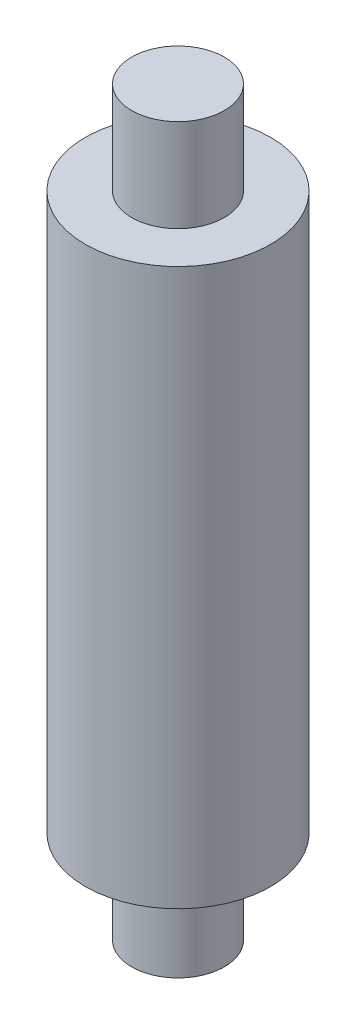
from build123d import *


with BuildPart() as part:
    # Sketch1 → Revolve1 (revolve)
    with BuildSketch(Plane.XY, mode=Mode.PRIVATE) as revolve1_sk:
        Polygon((0, 800), (50, 800), (50, 700), (100, 700), (100, 100), (50, 100), (50, 0), (0, 0), align=None)
    revolve(revolve1_sk.sketch.rotate(Axis((0, 0, 0), (0, 1, 0)), 90), axis=Axis((0, 0, 0), (0, 1, 0)))


solid = part.part
